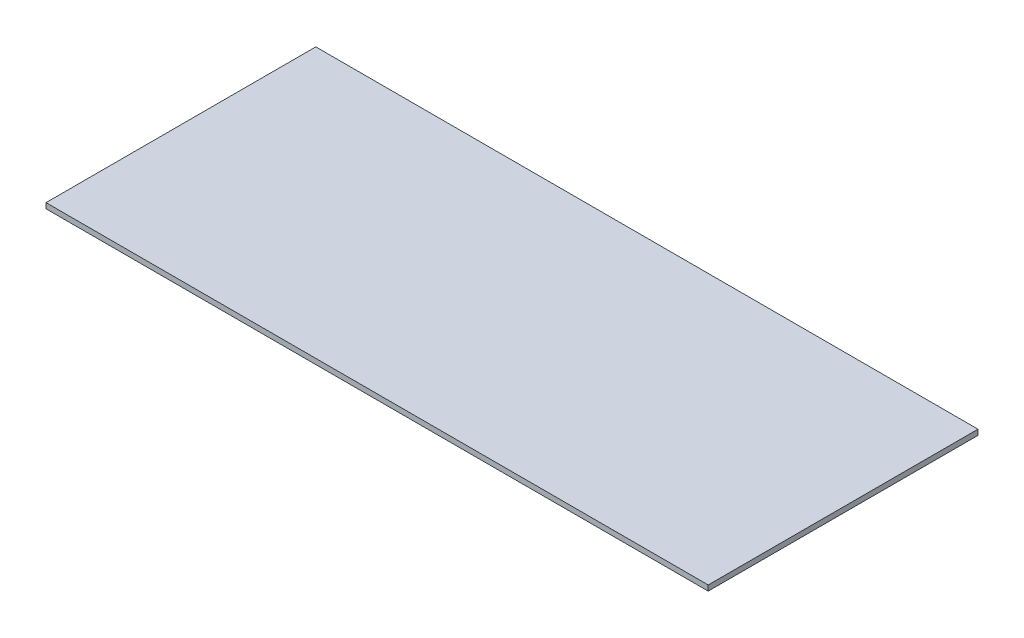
ISO-10303-21;
HEADER;
FILE_DESCRIPTION(('STEP AP214'),'2;1');
FILE_NAME('part.step','',(''),(''),'','','');
FILE_SCHEMA(('AUTOMOTIVE_DESIGN { 1 0 10303 214 1 1 1 1 }'));
ENDSEC;
DATA;
#1=APPLICATION_CONTEXT('core data for automotive mechanical design processes');
#2=APPLICATION_PROTOCOL_DEFINITION('international standard','automotive_design',2000,#1);
#3=PRODUCT_CONTEXT('',#1,'mechanical');
#4=PRODUCT('Part','Part','',(#3));
#5=PRODUCT_RELATED_PRODUCT_CATEGORY('part','',(#4));
#6=PRODUCT_DEFINITION_FORMATION('','',#4);
#7=PRODUCT_DEFINITION_CONTEXT('part definition',#1,'design');
#8=PRODUCT_DEFINITION('design','',#6,#7);
#9=PRODUCT_DEFINITION_SHAPE('','',#8);
#10=(LENGTH_UNIT() NAMED_UNIT(*) SI_UNIT(.MILLI.,.METRE.));
#11=(NAMED_UNIT(*) PLANE_ANGLE_UNIT() SI_UNIT($,.RADIAN.));
#12=(NAMED_UNIT(*) SI_UNIT($,.STERADIAN.) SOLID_ANGLE_UNIT());
#13=UNCERTAINTY_MEASURE_WITH_UNIT(LENGTH_MEASURE(1.E-05),#10,'distance_accuracy_value','');
#14=(GEOMETRIC_REPRESENTATION_CONTEXT(3) GLOBAL_UNCERTAINTY_ASSIGNED_CONTEXT((#13)) GLOBAL_UNIT_ASSIGNED_CONTEXT((#10,
#11,#12)) REPRESENTATION_CONTEXT('',''));
#15=CARTESIAN_POINT('',(0.,0.,0.));
#16=DIRECTION('',(0.,0.,1.));
#17=DIRECTION('',(1.,0.,0.));
#18=AXIS2_PLACEMENT_3D('',#15,#16,#17);
#19=CARTESIAN_POINT('',(342.9,5.55625,139.7));
#20=DIRECTION('',(-1.,0.,0.));
#21=DIRECTION('',(0.,0.,1.));
#22=AXIS2_PLACEMENT_3D('',#19,#20,#21);
#23=PLANE('',#22);
#24=DIRECTION('',(0.,0.,-1.));
#25=VECTOR('',#24,1.);
#26=CARTESIAN_POINT('',(342.9,0.,139.7));
#27=LINE('',#26,#25);
#28=CARTESIAN_POINT('',(342.9,0.,139.7));
#29=VERTEX_POINT('',#28);
#30=CARTESIAN_POINT('',(342.9,0.,-139.7));
#31=VERTEX_POINT('',#30);
#32=EDGE_CURVE('E106',#29,#31,#27,.T.);
#33=ORIENTED_EDGE('',*,*,#32,.T.);
#34=DIRECTION('',(0.,-1.,0.));
#35=VECTOR('',#34,1.);
#36=CARTESIAN_POINT('',(342.9,5.55625,-139.7));
#37=LINE('',#36,#35);
#38=CARTESIAN_POINT('',(342.9,5.55625,-139.7));
#39=VERTEX_POINT('',#38);
#40=EDGE_CURVE('E11',#39,#31,#37,.T.);
#41=ORIENTED_EDGE('',*,*,#40,.F.);
#42=DIRECTION('',(0.,0.,-1.));
#43=VECTOR('',#42,1.);
#44=CARTESIAN_POINT('',(342.9,5.55625,139.7));
#45=LINE('',#44,#43);
#46=CARTESIAN_POINT('',(342.9,5.55625,139.7));
#47=VERTEX_POINT('',#46);
#48=EDGE_CURVE('E89',#47,#39,#45,.T.);
#49=ORIENTED_EDGE('',*,*,#48,.F.);
#50=DIRECTION('',(0.,-1.,0.));
#51=VECTOR('',#50,1.);
#52=CARTESIAN_POINT('',(342.9,5.55625,139.7));
#53=LINE('',#52,#51);
#54=EDGE_CURVE('E102',#47,#29,#53,.T.);
#55=ORIENTED_EDGE('',*,*,#54,.T.);
#56=EDGE_LOOP('',(#33,#41,#49,#55));
#57=FACE_BOUND('',#56,.T.);
#58=ADVANCED_FACE('F37',(#57),#23,.F.);
#59=CARTESIAN_POINT('',(-342.9,5.55625,-139.7));
#60=DIRECTION('',(0.,0.,1.));
#61=DIRECTION('',(1.,0.,0.));
#62=AXIS2_PLACEMENT_3D('',#59,#60,#61);
#63=PLANE('',#62);
#64=DIRECTION('',(-1.,0.,0.));
#65=VECTOR('',#64,1.);
#66=CARTESIAN_POINT('',(-342.9,0.,-139.7));
#67=LINE('',#66,#65);
#68=CARTESIAN_POINT('',(-342.9,0.,-139.7));
#69=VERTEX_POINT('',#68);
#70=EDGE_CURVE('E94',#31,#69,#67,.T.);
#71=ORIENTED_EDGE('',*,*,#70,.T.);
#72=DIRECTION('',(0.,-1.,0.));
#73=VECTOR('',#72,1.);
#74=CARTESIAN_POINT('',(-342.9,5.55625,-139.7));
#75=LINE('',#74,#73);
#76=CARTESIAN_POINT('',(-342.9,5.55625,-139.7));
#77=VERTEX_POINT('',#76);
#78=EDGE_CURVE('E46',#77,#69,#75,.T.);
#79=ORIENTED_EDGE('',*,*,#78,.F.);
#80=DIRECTION('',(-1.,0.,0.));
#81=VECTOR('',#80,1.);
#82=CARTESIAN_POINT('',(-342.9,5.55625,-139.7));
#83=LINE('',#82,#81);
#84=EDGE_CURVE('E84',#39,#77,#83,.T.);
#85=ORIENTED_EDGE('',*,*,#84,.F.);
#86=ORIENTED_EDGE('',*,*,#40,.T.);
#87=EDGE_LOOP('',(#71,#79,#85,#86));
#88=FACE_BOUND('',#87,.T.);
#89=ADVANCED_FACE('F93',(#88),#63,.F.);
#90=CARTESIAN_POINT('',(-342.9,5.55625,139.7));
#91=DIRECTION('',(1.,0.,0.));
#92=DIRECTION('',(0.,0.,-1.));
#93=AXIS2_PLACEMENT_3D('',#90,#91,#92);
#94=PLANE('',#93);
#95=DIRECTION('',(0.,0.,1.));
#96=VECTOR('',#95,1.);
#97=CARTESIAN_POINT('',(-342.9,0.,139.7));
#98=LINE('',#97,#96);
#99=CARTESIAN_POINT('',(-342.9,0.,139.7));
#100=VERTEX_POINT('',#99);
#101=EDGE_CURVE('E71',#69,#100,#98,.T.);
#102=ORIENTED_EDGE('',*,*,#101,.T.);
#103=DIRECTION('',(0.,-1.,0.));
#104=VECTOR('',#103,1.);
#105=CARTESIAN_POINT('',(-342.9,5.55625,139.7));
#106=LINE('',#105,#104);
#107=CARTESIAN_POINT('',(-342.9,5.55625,139.7));
#108=VERTEX_POINT('',#107);
#109=EDGE_CURVE('E96',#108,#100,#106,.T.);
#110=ORIENTED_EDGE('',*,*,#109,.F.);
#111=DIRECTION('',(0.,0.,1.));
#112=VECTOR('',#111,1.);
#113=CARTESIAN_POINT('',(-342.9,5.55625,139.7));
#114=LINE('',#113,#112);
#115=EDGE_CURVE('E87',#77,#108,#114,.T.);
#116=ORIENTED_EDGE('',*,*,#115,.F.);
#117=ORIENTED_EDGE('',*,*,#78,.T.);
#118=EDGE_LOOP('',(#102,#110,#116,#117));
#119=FACE_BOUND('',#118,.T.);
#120=ADVANCED_FACE('F97',(#119),#94,.F.);
#121=CARTESIAN_POINT('',(-342.9,5.55625,139.7));
#122=DIRECTION('',(0.,0.,-1.));
#123=DIRECTION('',(-1.,0.,0.));
#124=AXIS2_PLACEMENT_3D('',#121,#122,#123);
#125=PLANE('',#124);
#126=DIRECTION('',(1.,0.,0.));
#127=VECTOR('',#126,1.);
#128=CARTESIAN_POINT('',(-342.9,0.,139.7));
#129=LINE('',#128,#127);
#130=EDGE_CURVE('E77',#100,#29,#129,.T.);
#131=ORIENTED_EDGE('',*,*,#130,.T.);
#132=ORIENTED_EDGE('',*,*,#54,.F.);
#133=DIRECTION('',(1.,0.,0.));
#134=VECTOR('',#133,1.);
#135=CARTESIAN_POINT('',(-342.9,5.55625,139.7));
#136=LINE('',#135,#134);
#137=EDGE_CURVE('E54',#108,#47,#136,.T.);
#138=ORIENTED_EDGE('',*,*,#137,.F.);
#139=ORIENTED_EDGE('',*,*,#109,.T.);
#140=EDGE_LOOP('',(#131,#132,#138,#139));
#141=FACE_BOUND('',#140,.T.);
#142=ADVANCED_FACE('F120',(#141),#125,.F.);
#143=CARTESIAN_POINT('',(0.,5.55625,0.));
#144=DIRECTION('',(0.,-1.,0.));
#145=DIRECTION('',(0.,0.,-1.));
#146=AXIS2_PLACEMENT_3D('',#143,#144,#145);
#147=PLANE('',#146);
#148=ORIENTED_EDGE('',*,*,#48,.T.);
#149=ORIENTED_EDGE('',*,*,#84,.T.);
#150=ORIENTED_EDGE('',*,*,#115,.T.);
#151=ORIENTED_EDGE('',*,*,#137,.T.);
#152=EDGE_LOOP('',(#148,#149,#150,#151));
#153=FACE_BOUND('',#152,.T.);
#154=ADVANCED_FACE('F85',(#153),#147,.F.);
#155=CARTESIAN_POINT('',(0.,0.,0.));
#156=DIRECTION('',(0.,-1.,0.));
#157=DIRECTION('',(0.,0.,-1.));
#158=AXIS2_PLACEMENT_3D('',#155,#156,#157);
#159=PLANE('',#158);
#160=ORIENTED_EDGE('',*,*,#32,.F.);
#161=ORIENTED_EDGE('',*,*,#130,.F.);
#162=ORIENTED_EDGE('',*,*,#101,.F.);
#163=ORIENTED_EDGE('',*,*,#70,.F.);
#164=EDGE_LOOP('',(#160,#161,#162,#163));
#165=FACE_BOUND('',#164,.T.);
#166=ADVANCED_FACE('F123',(#165),#159,.T.);
#167=CLOSED_SHELL('',(#58,#89,#120,#142,#154,#166));
#168=MANIFOLD_SOLID_BREP('B2',#167);
#169=ADVANCED_BREP_SHAPE_REPRESENTATION('',(#18,#168),#14);
#170=SHAPE_DEFINITION_REPRESENTATION(#9,#169);
ENDSEC;
END-ISO-10303-21;
